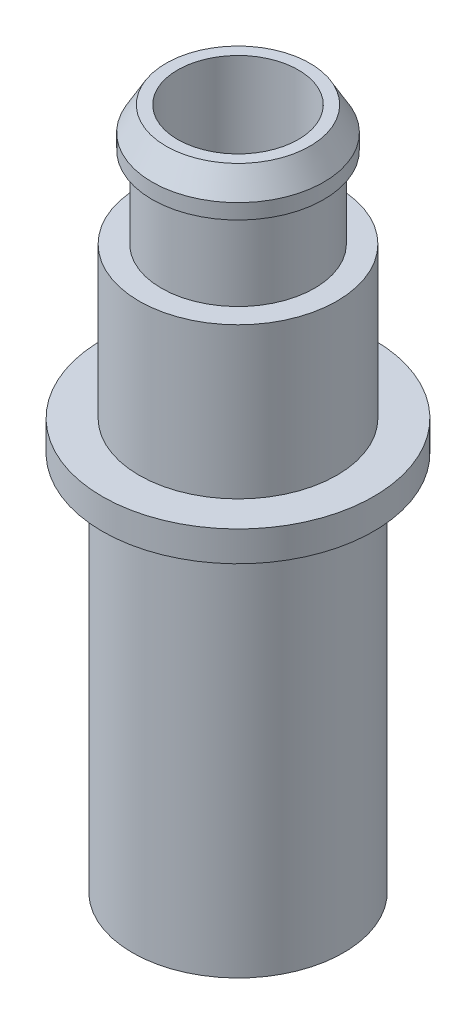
ISO-10303-21;
HEADER;
FILE_DESCRIPTION(('STEP AP214'),'2;1');
FILE_NAME('part.step','',(''),(''),'','','');
FILE_SCHEMA(('AUTOMOTIVE_DESIGN { 1 0 10303 214 1 1 1 1 }'));
ENDSEC;
DATA;
#1=APPLICATION_CONTEXT('core data for automotive mechanical design processes');
#2=APPLICATION_PROTOCOL_DEFINITION('international standard','automotive_design',2000,#1);
#3=PRODUCT_CONTEXT('',#1,'mechanical');
#4=PRODUCT('Part','Part','',(#3));
#5=PRODUCT_RELATED_PRODUCT_CATEGORY('part','',(#4));
#6=PRODUCT_DEFINITION_FORMATION('','',#4);
#7=PRODUCT_DEFINITION_CONTEXT('part definition',#1,'design');
#8=PRODUCT_DEFINITION('design','',#6,#7);
#9=PRODUCT_DEFINITION_SHAPE('','',#8);
#10=(LENGTH_UNIT() NAMED_UNIT(*) SI_UNIT(.MILLI.,.METRE.));
#11=(NAMED_UNIT(*) PLANE_ANGLE_UNIT() SI_UNIT($,.RADIAN.));
#12=(NAMED_UNIT(*) SI_UNIT($,.STERADIAN.) SOLID_ANGLE_UNIT());
#13=UNCERTAINTY_MEASURE_WITH_UNIT(LENGTH_MEASURE(1.E-05),#10,'distance_accuracy_value','');
#14=(GEOMETRIC_REPRESENTATION_CONTEXT(3) GLOBAL_UNCERTAINTY_ASSIGNED_CONTEXT((#13)) GLOBAL_UNIT_ASSIGNED_CONTEXT((#10,
#11,#12)) REPRESENTATION_CONTEXT('',''));
#15=CARTESIAN_POINT('',(0.,0.,0.));
#16=DIRECTION('',(0.,0.,1.));
#17=DIRECTION('',(1.,0.,0.));
#18=AXIS2_PLACEMENT_3D('',#15,#16,#17);
#19=CARTESIAN_POINT('',(0.,63.5,0.));
#20=DIRECTION('',(0.,-1.,0.));
#21=DIRECTION('',(0.,0.,-1.));
#22=AXIS2_PLACEMENT_3D('',#19,#20,#21);
#23=CYLINDRICAL_SURFACE('',#22,16.129);
#24=CARTESIAN_POINT('',(0.,38.1,0.));
#25=DIRECTION('',(0.,1.,0.));
#26=DIRECTION('',(0.,0.,1.));
#27=AXIS2_PLACEMENT_3D('',#24,#25,#26);
#28=CIRCLE('',#27,16.129);
#29=CARTESIAN_POINT('',(0.,38.1,16.129));
#30=VERTEX_POINT('',#29);
#31=EDGE_CURVE('E70',#30,#30,#28,.T.);
#32=ORIENTED_EDGE('',*,*,#31,.T.);
#33=EDGE_LOOP('',(#32));
#34=FACE_BOUND('',#33,.T.);
#35=CARTESIAN_POINT('',(0.,55.245,0.));
#36=DIRECTION('',(0.,1.,0.));
#37=DIRECTION('',(0.,0.,1.));
#38=AXIS2_PLACEMENT_3D('',#35,#36,#37);
#39=CIRCLE('',#38,16.129);
#40=CARTESIAN_POINT('',(0.,55.245,16.129));
#41=VERTEX_POINT('',#40);
#42=EDGE_CURVE('E45',#41,#41,#39,.T.);
#43=ORIENTED_EDGE('',*,*,#42,.F.);
#44=EDGE_LOOP('',(#43));
#45=FACE_BOUND('',#44,.T.);
#46=ADVANCED_FACE('F33',(#34,#45),#23,.T.);
#47=CARTESIAN_POINT('',(0.,38.1,0.));
#48=DIRECTION('',(0.,1.,0.));
#49=DIRECTION('',(0.,0.,1.));
#50=AXIS2_PLACEMENT_3D('',#47,#48,#49);
#51=PLANE('',#50);
#52=CARTESIAN_POINT('',(0.,38.1,0.));
#53=DIRECTION('',(0.,1.,0.));
#54=DIRECTION('',(0.,0.,1.));
#55=AXIS2_PLACEMENT_3D('',#52,#53,#54);
#56=CIRCLE('',#55,20.828);
#57=CARTESIAN_POINT('',(0.,38.1,20.828));
#58=VERTEX_POINT('',#57);
#59=EDGE_CURVE('E64',#58,#58,#56,.T.);
#60=ORIENTED_EDGE('',*,*,#59,.T.);
#61=EDGE_LOOP('',(#60));
#62=FACE_BOUND('',#61,.T.);
#63=ORIENTED_EDGE('',*,*,#31,.F.);
#64=EDGE_LOOP('',(#63));
#65=FACE_BOUND('',#64,.T.);
#66=ADVANCED_FACE('F96',(#62,#65),#51,.T.);
#67=CARTESIAN_POINT('',(0.,6.35,0.));
#68=DIRECTION('',(0.,1.,0.));
#69=DIRECTION('',(0.,0.,1.));
#70=AXIS2_PLACEMENT_3D('',#67,#68,#69);
#71=PLANE('',#70);
#72=CARTESIAN_POINT('',(0.,6.35,0.));
#73=DIRECTION('',(0.,1.,0.));
#74=DIRECTION('',(0.,0.,1.));
#75=AXIS2_PLACEMENT_3D('',#72,#73,#74);
#76=CIRCLE('',#75,28.575);
#77=CARTESIAN_POINT('',(0.,6.35,28.575));
#78=VERTEX_POINT('',#77);
#79=EDGE_CURVE('E60',#78,#78,#76,.T.);
#80=ORIENTED_EDGE('',*,*,#79,.T.);
#81=EDGE_LOOP('',(#80));
#82=FACE_BOUND('',#81,.T.);
#83=CARTESIAN_POINT('',(0.,6.35,0.));
#84=DIRECTION('',(0.,1.,0.));
#85=DIRECTION('',(0.,0.,1.));
#86=AXIS2_PLACEMENT_3D('',#83,#84,#85);
#87=CIRCLE('',#86,20.828);
#88=CARTESIAN_POINT('',(0.,6.35,20.828));
#89=VERTEX_POINT('',#88);
#90=EDGE_CURVE('E67',#89,#89,#87,.T.);
#91=ORIENTED_EDGE('',*,*,#90,.F.);
#92=EDGE_LOOP('',(#91));
#93=FACE_BOUND('',#92,.T.);
#94=ADVANCED_FACE('F102',(#82,#93),#71,.T.);
#95=CARTESIAN_POINT('',(0.,-80.01,0.));
#96=DIRECTION('',(0.,1.,0.));
#97=DIRECTION('',(0.,0.,1.));
#98=AXIS2_PLACEMENT_3D('',#95,#96,#97);
#99=CYLINDRICAL_SURFACE('',#98,22.225);
#100=CARTESIAN_POINT('',(0.,-80.01,0.));
#101=DIRECTION('',(0.,1.,0.));
#102=DIRECTION('',(0.,0.,1.));
#103=AXIS2_PLACEMENT_3D('',#100,#101,#102);
#104=CIRCLE('',#103,22.225);
#105=CARTESIAN_POINT('',(0.,-80.01,22.225));
#106=VERTEX_POINT('',#105);
#107=EDGE_CURVE('E49',#106,#106,#104,.T.);
#108=ORIENTED_EDGE('',*,*,#107,.T.);
#109=EDGE_LOOP('',(#108));
#110=FACE_BOUND('',#109,.T.);
#111=CARTESIAN_POINT('',(0.,0.,0.));
#112=DIRECTION('',(0.,1.,0.));
#113=DIRECTION('',(0.,0.,1.));
#114=AXIS2_PLACEMENT_3D('',#111,#112,#113);
#115=CIRCLE('',#114,22.225);
#116=CARTESIAN_POINT('',(0.,0.,22.225));
#117=VERTEX_POINT('',#116);
#118=EDGE_CURVE('E52',#117,#117,#115,.T.);
#119=ORIENTED_EDGE('',*,*,#118,.F.);
#120=EDGE_LOOP('',(#119));
#121=FACE_BOUND('',#120,.T.);
#122=ADVANCED_FACE('F115',(#110,#121),#99,.T.);
#123=CARTESIAN_POINT('',(0.,-80.01,0.));
#124=DIRECTION('',(0.,1.,0.));
#125=DIRECTION('',(0.,0.,1.));
#126=AXIS2_PLACEMENT_3D('',#123,#124,#125);
#127=PLANE('',#126);
#128=CARTESIAN_POINT('',(0.,-80.01,0.));
#129=DIRECTION('',(0.,1.,0.));
#130=DIRECTION('',(0.,0.,1.));
#131=AXIS2_PLACEMENT_3D('',#128,#129,#130);
#132=CIRCLE('',#131,12.7);
#133=CARTESIAN_POINT('',(0.,-80.01,12.7));
#134=VERTEX_POINT('',#133);
#135=EDGE_CURVE('E55',#134,#134,#132,.T.);
#136=ORIENTED_EDGE('',*,*,#135,.T.);
#137=EDGE_LOOP('',(#136));
#138=FACE_BOUND('',#137,.T.);
#139=ORIENTED_EDGE('',*,*,#107,.F.);
#140=EDGE_LOOP('',(#139));
#141=FACE_BOUND('',#140,.T.);
#142=ADVANCED_FACE('F127',(#138,#141),#127,.F.);
#143=CARTESIAN_POINT('',(0.,-80.01,0.));
#144=DIRECTION('',(0.,1.,0.));
#145=DIRECTION('',(0.,0.,1.));
#146=AXIS2_PLACEMENT_3D('',#143,#144,#145);
#147=CYLINDRICAL_SURFACE('',#146,12.7);
#148=CARTESIAN_POINT('',(0.,63.5,0.));
#149=DIRECTION('',(0.,1.,0.));
#150=DIRECTION('',(0.,0.,1.));
#151=AXIS2_PLACEMENT_3D('',#148,#149,#150);
#152=CIRCLE('',#151,12.7);
#153=CARTESIAN_POINT('',(0.,63.5,12.7));
#154=VERTEX_POINT('',#153);
#155=EDGE_CURVE('E75',#154,#154,#152,.T.);
#156=ORIENTED_EDGE('',*,*,#155,.T.);
#157=EDGE_LOOP('',(#156));
#158=FACE_BOUND('',#157,.T.);
#159=ORIENTED_EDGE('',*,*,#135,.F.);
#160=EDGE_LOOP('',(#159));
#161=FACE_BOUND('',#160,.T.);
#162=ADVANCED_FACE('F120',(#158,#161),#147,.F.);
#163=CARTESIAN_POINT('',(0.,0.,0.));
#164=DIRECTION('',(0.,1.,0.));
#165=DIRECTION('',(0.,0.,1.));
#166=AXIS2_PLACEMENT_3D('',#163,#164,#165);
#167=PLANE('',#166);
#168=ORIENTED_EDGE('',*,*,#118,.T.);
#169=EDGE_LOOP('',(#168));
#170=FACE_BOUND('',#169,.T.);
#171=CARTESIAN_POINT('',(0.,0.,0.));
#172=DIRECTION('',(0.,1.,0.));
#173=DIRECTION('',(0.,0.,1.));
#174=AXIS2_PLACEMENT_3D('',#171,#172,#173);
#175=CIRCLE('',#174,28.575);
#176=CARTESIAN_POINT('',(0.,0.,28.575));
#177=VERTEX_POINT('',#176);
#178=EDGE_CURVE('E61',#177,#177,#175,.T.);
#179=ORIENTED_EDGE('',*,*,#178,.F.);
#180=EDGE_LOOP('',(#179));
#181=FACE_BOUND('',#180,.T.);
#182=ADVANCED_FACE('F117',(#170,#181),#167,.F.);
#183=CARTESIAN_POINT('',(0.,6.35,0.));
#184=DIRECTION('',(0.,-1.,0.));
#185=DIRECTION('',(0.,0.,-1.));
#186=AXIS2_PLACEMENT_3D('',#183,#184,#185);
#187=CYLINDRICAL_SURFACE('',#186,28.575);
#188=ORIENTED_EDGE('',*,*,#79,.F.);
#189=EDGE_LOOP('',(#188));
#190=FACE_BOUND('',#189,.T.);
#191=ORIENTED_EDGE('',*,*,#178,.T.);
#192=EDGE_LOOP('',(#191));
#193=FACE_BOUND('',#192,.T.);
#194=ADVANCED_FACE('F111',(#190,#193),#187,.T.);
#195=CARTESIAN_POINT('',(0.,38.1,0.));
#196=DIRECTION('',(0.,-1.,0.));
#197=DIRECTION('',(0.,0.,-1.));
#198=AXIS2_PLACEMENT_3D('',#195,#196,#197);
#199=CYLINDRICAL_SURFACE('',#198,20.828);
#200=ORIENTED_EDGE('',*,*,#59,.F.);
#201=EDGE_LOOP('',(#200));
#202=FACE_BOUND('',#201,.T.);
#203=ORIENTED_EDGE('',*,*,#90,.T.);
#204=EDGE_LOOP('',(#203));
#205=FACE_BOUND('',#204,.T.);
#206=ADVANCED_FACE('F108',(#202,#205),#199,.T.);
#207=CARTESIAN_POINT('',(0.,63.5,0.));
#208=DIRECTION('',(0.,1.,0.));
#209=DIRECTION('',(0.,0.,1.));
#210=AXIS2_PLACEMENT_3D('',#207,#208,#209);
#211=PLANE('',#210);
#212=CARTESIAN_POINT('',(0.,63.5,0.));
#213=DIRECTION('',(0.,1.,0.));
#214=DIRECTION('',(0.,0.,1.));
#215=AXIS2_PLACEMENT_3D('',#212,#213,#214);
#216=CIRCLE('',#215,15.1391606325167);
#217=CARTESIAN_POINT('',(0.,63.5,15.1391606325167));
#218=VERTEX_POINT('',#217);
#219=EDGE_CURVE('E41',#218,#218,#216,.T.);
#220=ORIENTED_EDGE('',*,*,#219,.T.);
#221=EDGE_LOOP('',(#220));
#222=FACE_BOUND('',#221,.T.);
#223=ORIENTED_EDGE('',*,*,#155,.F.);
#224=EDGE_LOOP('',(#223));
#225=FACE_BOUND('',#224,.T.);
#226=ADVANCED_FACE('F93',(#222,#225),#211,.T.);
#227=CARTESIAN_POINT('',(0.,55.245,0.));
#228=DIRECTION('',(0.,1.,0.));
#229=DIRECTION('',(0.,0.,1.));
#230=AXIS2_PLACEMENT_3D('',#227,#228,#229);
#231=CYLINDRICAL_SURFACE('',#230,18.0721);
#232=CARTESIAN_POINT('',(0.,58.42,0.));
#233=DIRECTION('',(0.,1.,0.));
#234=DIRECTION('',(0.,0.,1.));
#235=AXIS2_PLACEMENT_3D('',#232,#233,#234);
#236=CIRCLE('',#235,18.0721);
#237=CARTESIAN_POINT('',(0.,58.42,18.0721));
#238=VERTEX_POINT('',#237);
#239=EDGE_CURVE('E10',#238,#238,#236,.F.);
#240=ORIENTED_EDGE('',*,*,#239,.T.);
#241=EDGE_LOOP('',(#240));
#242=FACE_BOUND('',#241,.T.);
#243=CARTESIAN_POINT('',(0.,55.245,0.));
#244=DIRECTION('',(0.,1.,0.));
#245=DIRECTION('',(0.,0.,1.));
#246=AXIS2_PLACEMENT_3D('',#243,#244,#245);
#247=CIRCLE('',#246,18.0721);
#248=CARTESIAN_POINT('',(0.,55.245,18.0721));
#249=VERTEX_POINT('',#248);
#250=EDGE_CURVE('E78',#249,#249,#247,.T.);
#251=ORIENTED_EDGE('',*,*,#250,.T.);
#252=EDGE_LOOP('',(#251));
#253=FACE_BOUND('',#252,.T.);
#254=ADVANCED_FACE('F82',(#242,#253),#231,.T.);
#255=CARTESIAN_POINT('',(0.,55.245,0.));
#256=DIRECTION('',(0.,1.,0.));
#257=DIRECTION('',(0.,0.,1.));
#258=AXIS2_PLACEMENT_3D('',#255,#256,#257);
#259=PLANE('',#258);
#260=ORIENTED_EDGE('',*,*,#42,.T.);
#261=EDGE_LOOP('',(#260));
#262=FACE_BOUND('',#261,.T.);
#263=ORIENTED_EDGE('',*,*,#250,.F.);
#264=EDGE_LOOP('',(#263));
#265=FACE_BOUND('',#264,.T.);
#266=ADVANCED_FACE('F84',(#262,#265),#259,.F.);
#267=CARTESIAN_POINT('',(0.,63.5,0.));
#268=DIRECTION('',(0.,-1.,0.));
#269=DIRECTION('',(0.,0.,-1.));
#270=AXIS2_PLACEMENT_3D('',#267,#268,#269);
#271=CONICAL_SURFACE('',#270,15.1391606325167,0.523598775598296);
#272=ORIENTED_EDGE('',*,*,#239,.F.);
#273=EDGE_LOOP('',(#272));
#274=FACE_BOUND('',#273,.T.);
#275=ORIENTED_EDGE('',*,*,#219,.F.);
#276=EDGE_LOOP('',(#275));
#277=FACE_BOUND('',#276,.T.);
#278=ADVANCED_FACE('F36',(#274,#277),#271,.T.);
#279=CLOSED_SHELL('',(#46,#66,#94,#122,#142,#162,#182,#194,#206,#226,#254,#266,#278));
#280=MANIFOLD_SOLID_BREP('B2',#279);
#281=ADVANCED_BREP_SHAPE_REPRESENTATION('',(#18,#280),#14);
#282=SHAPE_DEFINITION_REPRESENTATION(#9,#281);
ENDSEC;
END-ISO-10303-21;
